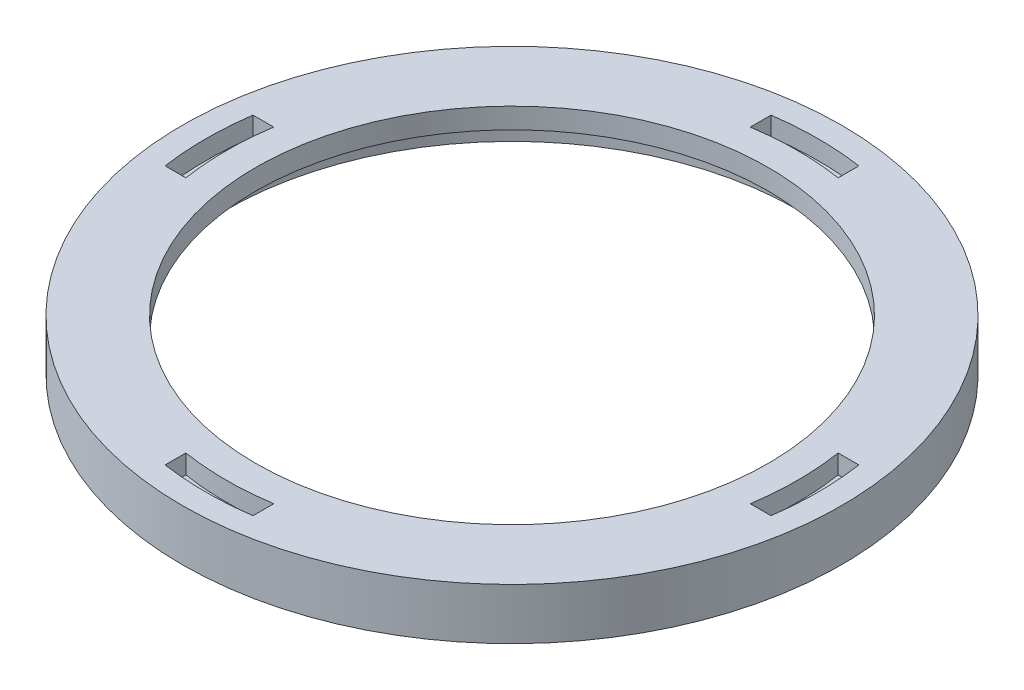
from build123d import *

# Parameters (mm, degrees)
SKETCH1_R            = 28.575
SHAFT_DEPTH          = 4.445
SKETCH11_R           = 22.225
THRU_HOLE_DEPTH      = 41.654880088
TOOLING_POINTS_DEPTH = 1.651
RETAINER_START       = -2.667
SKETCH12_R           = 24.765
RETAINER_HOLE_DEPTH  = 2.667


with BuildPart() as part:
    # Sketch1 → Shaft (new body)
    with BuildSketch(Plane(origin=(0, 0, 0), x_dir=(1, 0, 0), z_dir=(0, 1, 0))):
        with Locations(Location((0, 0, 0), (0, 0, 270))):
            Circle(SKETCH1_R)
    extrude(amount=-SHAFT_DEPTH)

    # Sketch11 → Thru Hole (cut, through all)
    with BuildSketch(Plane(origin=(0, 0, 0), x_dir=(-1, 0, 0), z_dir=(0, 1, 0))):
        with Locations(Location((0, 0, 0), (0, 0, 90))):
            Circle(SKETCH11_R)
    extrude(amount=-THRU_HOLE_DEPTH, mode=Mode.SUBTRACT)

    # Sketch13 → Tooling Points (cut)
    with BuildSketch(Plane(origin=(0, 0, 0), x_dir=(-1, 0, 0), z_dir=(0, 1, 0))):
        with BuildLine():
            Line((-24.470168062, -3.81), (-26.268131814, -3.81))
            ThreePointArc((-26.268131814, -3.81), (-26.543, 0), (-26.268131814, 3.81))
            Line((-26.268131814, 3.81), (-24.470168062, 3.81))
            ThreePointArc((-24.470168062, 3.81), (-24.765, 0), (-24.470168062, -3.81))
        make_face()
        with BuildLine():
            Line((3.81, -24.470168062), (3.81, -26.268131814))
            ThreePointArc((3.81, -26.268131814), (0, -26.543), (-3.81, -26.268131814))
            Line((-3.81, -26.268131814), (-3.81, -24.470168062))
            ThreePointArc((-3.81, -24.470168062), (0, -24.765), (3.81, -24.470168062))
        make_face()
        with BuildLine():
            Line((24.470168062, 3.81), (26.268131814, 3.81))
            ThreePointArc((26.268131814, 3.81), (26.543, 0), (26.268131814, -3.81))
            Line((26.268131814, -3.81), (24.470168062, -3.81))
            ThreePointArc((24.470168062, -3.81), (24.765, 0), (24.470168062, 3.81))
        make_face()
        with BuildLine():
            Line((-3.81, 24.470168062), (-3.81, 26.268131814))
            ThreePointArc((-3.81, 26.268131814), (0, 26.543), (3.81, 26.268131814))
            Line((3.81, 26.268131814), (3.81, 24.470168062))
            ThreePointArc((3.81, 24.470168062), (0, 24.765), (-3.81, 24.470168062))
        make_face()
    extrude(amount=-TOOLING_POINTS_DEPTH, mode=Mode.SUBTRACT)

    # Sketch12 → Retainer Hole (cut)
    with BuildSketch(Plane.XZ.offset(4.445).offset(RETAINER_START)):
        with Locations(Location((0, 0, 0), (0, 0, 270))):
            Circle(SKETCH12_R)
    extrude(amount=RETAINER_HOLE_DEPTH, mode=Mode.SUBTRACT)


solid = part.part
